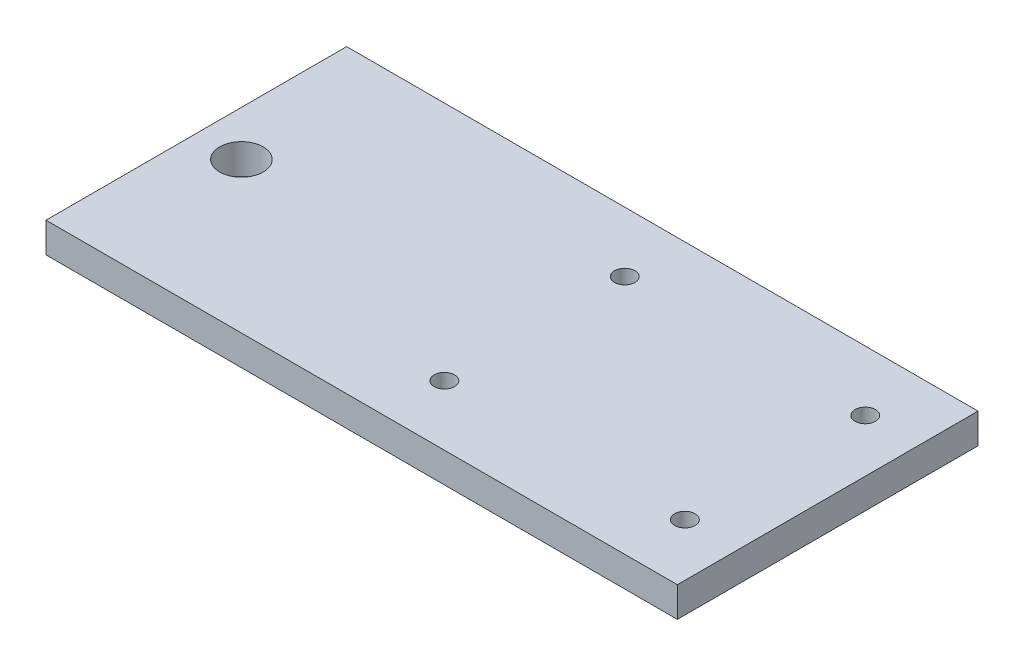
ISO-10303-21;
HEADER;
FILE_DESCRIPTION(('STEP AP214'),'2;1');
FILE_NAME('part.step','',(''),(''),'','','');
FILE_SCHEMA(('AUTOMOTIVE_DESIGN { 1 0 10303 214 1 1 1 1 }'));
ENDSEC;
DATA;
#1=APPLICATION_CONTEXT('core data for automotive mechanical design processes');
#2=APPLICATION_PROTOCOL_DEFINITION('international standard','automotive_design',2000,#1);
#3=PRODUCT_CONTEXT('',#1,'mechanical');
#4=PRODUCT('Part','Part','',(#3));
#5=PRODUCT_RELATED_PRODUCT_CATEGORY('part','',(#4));
#6=PRODUCT_DEFINITION_FORMATION('','',#4);
#7=PRODUCT_DEFINITION_CONTEXT('part definition',#1,'design');
#8=PRODUCT_DEFINITION('design','',#6,#7);
#9=PRODUCT_DEFINITION_SHAPE('','',#8);
#10=(LENGTH_UNIT() NAMED_UNIT(*) SI_UNIT(.MILLI.,.METRE.));
#11=(NAMED_UNIT(*) PLANE_ANGLE_UNIT() SI_UNIT($,.RADIAN.));
#12=(NAMED_UNIT(*) SI_UNIT($,.STERADIAN.) SOLID_ANGLE_UNIT());
#13=UNCERTAINTY_MEASURE_WITH_UNIT(LENGTH_MEASURE(1.E-05),#10,'distance_accuracy_value','');
#14=(GEOMETRIC_REPRESENTATION_CONTEXT(3) GLOBAL_UNCERTAINTY_ASSIGNED_CONTEXT((#13)) GLOBAL_UNIT_ASSIGNED_CONTEXT((#10,
#11,#12)) REPRESENTATION_CONTEXT('',''));
#15=CARTESIAN_POINT('',(0.,0.,0.));
#16=DIRECTION('',(0.,0.,1.));
#17=DIRECTION('',(1.,0.,0.));
#18=AXIS2_PLACEMENT_3D('',#15,#16,#17);
#19=CARTESIAN_POINT('',(105.,0.,50.));
#20=DIRECTION('',(0.,-1.,0.));
#21=DIRECTION('',(0.,0.,-1.));
#22=AXIS2_PLACEMENT_3D('',#19,#20,#21);
#23=PLANE('',#22);
#24=CARTESIAN_POINT('',(7.50000000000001,0.,-29.9999999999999));
#25=DIRECTION('',(0.,1.,0.));
#26=DIRECTION('',(0.,0.,1.));
#27=AXIS2_PLACEMENT_3D('',#24,#25,#26);
#28=CIRCLE('',#27,3.39999999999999);
#29=CARTESIAN_POINT('',(7.50000000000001,0.,-26.5999999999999));
#30=VERTEX_POINT('',#29);
#31=EDGE_CURVE('E208',#30,#30,#28,.T.);
#32=ORIENTED_EDGE('',*,*,#31,.F.);
#33=EDGE_LOOP('',(#32));
#34=FACE_BOUND('',#33,.T.);
#35=CARTESIAN_POINT('',(87.5000000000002,0.,30.));
#36=DIRECTION('',(0.,1.,0.));
#37=DIRECTION('',(0.,0.,1.));
#38=AXIS2_PLACEMENT_3D('',#35,#36,#37);
#39=CIRCLE('',#38,3.39999999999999);
#40=CARTESIAN_POINT('',(87.5000000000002,0.,33.4));
#41=VERTEX_POINT('',#40);
#42=EDGE_CURVE('E221',#41,#41,#39,.T.);
#43=ORIENTED_EDGE('',*,*,#42,.F.);
#44=EDGE_LOOP('',(#43));
#45=FACE_BOUND('',#44,.T.);
#46=CARTESIAN_POINT('',(-90.,0.,0.));
#47=DIRECTION('',(0.,1.,0.));
#48=DIRECTION('',(0.,0.,1.));
#49=AXIS2_PLACEMENT_3D('',#46,#47,#48);
#50=CIRCLE('',#49,7.25000000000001);
#51=CARTESIAN_POINT('',(-90.,0.,7.25000000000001));
#52=VERTEX_POINT('',#51);
#53=EDGE_CURVE('E107',#52,#52,#50,.T.);
#54=ORIENTED_EDGE('',*,*,#53,.F.);
#55=EDGE_LOOP('',(#54));
#56=FACE_BOUND('',#55,.T.);
#57=DIRECTION('',(0.,0.,1.));
#58=VECTOR('',#57,1.);
#59=CARTESIAN_POINT('',(-105.,0.,50.));
#60=LINE('',#59,#58);
#61=CARTESIAN_POINT('',(-105.,0.,-50.));
#62=VERTEX_POINT('',#61);
#63=CARTESIAN_POINT('',(-105.,0.,50.));
#64=VERTEX_POINT('',#63);
#65=EDGE_CURVE('E113',#62,#64,#60,.T.);
#66=ORIENTED_EDGE('',*,*,#65,.T.);
#67=DIRECTION('',(-1.,0.,0.));
#68=VECTOR('',#67,1.);
#69=CARTESIAN_POINT('',(105.,0.,50.));
#70=LINE('',#69,#68);
#71=CARTESIAN_POINT('',(105.,0.,50.));
#72=VERTEX_POINT('',#71);
#73=EDGE_CURVE('E99',#72,#64,#70,.T.);
#74=ORIENTED_EDGE('',*,*,#73,.F.);
#75=DIRECTION('',(0.,0.,1.));
#76=VECTOR('',#75,1.);
#77=CARTESIAN_POINT('',(105.,0.,50.));
#78=LINE('',#77,#76);
#79=CARTESIAN_POINT('',(105.,0.,-50.));
#80=VERTEX_POINT('',#79);
#81=EDGE_CURVE('E56',#80,#72,#78,.T.);
#82=ORIENTED_EDGE('',*,*,#81,.F.);
#83=DIRECTION('',(-1.,0.,0.));
#84=VECTOR('',#83,1.);
#85=CARTESIAN_POINT('',(105.,0.,-50.));
#86=LINE('',#85,#84);
#87=EDGE_CURVE('E126',#80,#62,#86,.T.);
#88=ORIENTED_EDGE('',*,*,#87,.T.);
#89=EDGE_LOOP('',(#66,#74,#82,#88));
#90=FACE_BOUND('',#89,.T.);
#91=CARTESIAN_POINT('',(87.5,0.,-30.));
#92=DIRECTION('',(0.,1.,0.));
#93=DIRECTION('',(0.,0.,1.));
#94=AXIS2_PLACEMENT_3D('',#91,#92,#93);
#95=CIRCLE('',#94,3.39999999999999);
#96=CARTESIAN_POINT('',(87.5,0.,-26.6));
#97=VERTEX_POINT('',#96);
#98=EDGE_CURVE('E215',#97,#97,#95,.T.);
#99=ORIENTED_EDGE('',*,*,#98,.F.);
#100=EDGE_LOOP('',(#99));
#101=FACE_BOUND('',#100,.T.);
#102=CARTESIAN_POINT('',(7.49999999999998,0.,30.));
#103=DIRECTION('',(0.,1.,0.));
#104=DIRECTION('',(0.,0.,1.));
#105=AXIS2_PLACEMENT_3D('',#102,#103,#104);
#106=CIRCLE('',#105,3.39999999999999);
#107=CARTESIAN_POINT('',(7.49999999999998,0.,33.4));
#108=VERTEX_POINT('',#107);
#109=EDGE_CURVE('E202',#108,#108,#106,.T.);
#110=ORIENTED_EDGE('',*,*,#109,.F.);
#111=EDGE_LOOP('',(#110));
#112=FACE_BOUND('',#111,.T.);
#113=ADVANCED_FACE('F40',(#34,#45,#56,#90,#101,#112),#23,.F.);
#114=CARTESIAN_POINT('',(105.,0.,50.));
#115=DIRECTION('',(0.,0.,-1.));
#116=DIRECTION('',(-1.,0.,0.));
#117=AXIS2_PLACEMENT_3D('',#114,#115,#116);
#118=PLANE('',#117);
#119=DIRECTION('',(0.,-1.,0.));
#120=VECTOR('',#119,1.);
#121=CARTESIAN_POINT('',(-105.,0.,50.));
#122=LINE('',#121,#120);
#123=CARTESIAN_POINT('',(-105.,-10.,50.));
#124=VERTEX_POINT('',#123);
#125=EDGE_CURVE('E86',#64,#124,#122,.T.);
#126=ORIENTED_EDGE('',*,*,#125,.T.);
#127=DIRECTION('',(-1.,0.,0.));
#128=VECTOR('',#127,1.);
#129=CARTESIAN_POINT('',(105.,-10.,50.));
#130=LINE('',#129,#128);
#131=CARTESIAN_POINT('',(105.,-10.,50.));
#132=VERTEX_POINT('',#131);
#133=EDGE_CURVE('E11',#132,#124,#130,.T.);
#134=ORIENTED_EDGE('',*,*,#133,.F.);
#135=DIRECTION('',(0.,-1.,0.));
#136=VECTOR('',#135,1.);
#137=CARTESIAN_POINT('',(105.,0.,50.));
#138=LINE('',#137,#136);
#139=EDGE_CURVE('E116',#72,#132,#138,.T.);
#140=ORIENTED_EDGE('',*,*,#139,.F.);
#141=ORIENTED_EDGE('',*,*,#73,.T.);
#142=EDGE_LOOP('',(#126,#134,#140,#141));
#143=FACE_BOUND('',#142,.T.);
#144=ADVANCED_FACE('F42',(#143),#118,.F.);
#145=CARTESIAN_POINT('',(105.,-10.,50.));
#146=DIRECTION('',(0.,1.,0.));
#147=DIRECTION('',(0.,0.,1.));
#148=AXIS2_PLACEMENT_3D('',#145,#146,#147);
#149=PLANE('',#148);
#150=CARTESIAN_POINT('',(7.49999999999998,-10.,30.));
#151=DIRECTION('',(0.,1.,0.));
#152=DIRECTION('',(0.,0.,1.));
#153=AXIS2_PLACEMENT_3D('',#150,#151,#152);
#154=CIRCLE('',#153,3.39999999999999);
#155=CARTESIAN_POINT('',(7.49999999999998,-10.,33.4));
#156=VERTEX_POINT('',#155);
#157=EDGE_CURVE('E160',#156,#156,#154,.T.);
#158=ORIENTED_EDGE('',*,*,#157,.T.);
#159=EDGE_LOOP('',(#158));
#160=FACE_BOUND('',#159,.T.);
#161=CARTESIAN_POINT('',(7.50000000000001,-10.,-29.9999999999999));
#162=DIRECTION('',(0.,1.,0.));
#163=DIRECTION('',(0.,0.,1.));
#164=AXIS2_PLACEMENT_3D('',#161,#162,#163);
#165=CIRCLE('',#164,3.39999999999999);
#166=CARTESIAN_POINT('',(7.50000000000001,-10.,-26.5999999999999));
#167=VERTEX_POINT('',#166);
#168=EDGE_CURVE('E164',#167,#167,#165,.T.);
#169=ORIENTED_EDGE('',*,*,#168,.T.);
#170=EDGE_LOOP('',(#169));
#171=FACE_BOUND('',#170,.T.);
#172=CARTESIAN_POINT('',(87.5000000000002,-10.,-30.));
#173=DIRECTION('',(0.,1.,0.));
#174=DIRECTION('',(0.,0.,1.));
#175=AXIS2_PLACEMENT_3D('',#172,#173,#174);
#176=CIRCLE('',#175,3.39999999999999);
#177=CARTESIAN_POINT('',(87.5000000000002,-10.,-26.6));
#178=VERTEX_POINT('',#177);
#179=EDGE_CURVE('E168',#178,#178,#176,.T.);
#180=ORIENTED_EDGE('',*,*,#179,.T.);
#181=EDGE_LOOP('',(#180));
#182=FACE_BOUND('',#181,.T.);
#183=CARTESIAN_POINT('',(87.5,-10.,30.));
#184=DIRECTION('',(0.,1.,0.));
#185=DIRECTION('',(0.,0.,1.));
#186=AXIS2_PLACEMENT_3D('',#183,#184,#185);
#187=CIRCLE('',#186,3.39999999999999);
#188=CARTESIAN_POINT('',(87.5,-10.,33.4));
#189=VERTEX_POINT('',#188);
#190=EDGE_CURVE('E172',#189,#189,#187,.T.);
#191=ORIENTED_EDGE('',*,*,#190,.T.);
#192=EDGE_LOOP('',(#191));
#193=FACE_BOUND('',#192,.T.);
#194=CARTESIAN_POINT('',(-90.,-10.,0.));
#195=DIRECTION('',(0.,1.,0.));
#196=DIRECTION('',(0.,0.,1.));
#197=AXIS2_PLACEMENT_3D('',#194,#195,#196);
#198=CIRCLE('',#197,7.25000000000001);
#199=CARTESIAN_POINT('',(-90.,-10.,7.25000000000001));
#200=VERTEX_POINT('',#199);
#201=EDGE_CURVE('E101',#200,#200,#198,.T.);
#202=ORIENTED_EDGE('',*,*,#201,.T.);
#203=EDGE_LOOP('',(#202));
#204=FACE_BOUND('',#203,.T.);
#205=DIRECTION('',(0.,0.,-1.));
#206=VECTOR('',#205,1.);
#207=CARTESIAN_POINT('',(-105.,-10.,50.));
#208=LINE('',#207,#206);
#209=CARTESIAN_POINT('',(-105.,-10.,-50.));
#210=VERTEX_POINT('',#209);
#211=EDGE_CURVE('E82',#124,#210,#208,.T.);
#212=ORIENTED_EDGE('',*,*,#211,.T.);
#213=DIRECTION('',(-1.,0.,0.));
#214=VECTOR('',#213,1.);
#215=CARTESIAN_POINT('',(105.,-10.,-50.));
#216=LINE('',#215,#214);
#217=CARTESIAN_POINT('',(105.,-10.,-50.));
#218=VERTEX_POINT('',#217);
#219=EDGE_CURVE('E49',#218,#210,#216,.T.);
#220=ORIENTED_EDGE('',*,*,#219,.F.);
#221=DIRECTION('',(0.,0.,-1.));
#222=VECTOR('',#221,1.);
#223=CARTESIAN_POINT('',(105.,-10.,50.));
#224=LINE('',#223,#222);
#225=EDGE_CURVE('E95',#132,#218,#224,.T.);
#226=ORIENTED_EDGE('',*,*,#225,.F.);
#227=ORIENTED_EDGE('',*,*,#133,.T.);
#228=EDGE_LOOP('',(#212,#220,#226,#227));
#229=FACE_BOUND('',#228,.T.);
#230=ADVANCED_FACE('F94',(#160,#171,#182,#193,#204,#229),#149,.F.);
#231=CARTESIAN_POINT('',(105.,0.,-50.));
#232=DIRECTION('',(0.,0.,1.));
#233=DIRECTION('',(1.,0.,0.));
#234=AXIS2_PLACEMENT_3D('',#231,#232,#233);
#235=PLANE('',#234);
#236=DIRECTION('',(0.,1.,0.));
#237=VECTOR('',#236,1.);
#238=CARTESIAN_POINT('',(-105.,0.,-50.));
#239=LINE('',#238,#237);
#240=EDGE_CURVE('E87',#210,#62,#239,.T.);
#241=ORIENTED_EDGE('',*,*,#240,.T.);
#242=ORIENTED_EDGE('',*,*,#87,.F.);
#243=DIRECTION('',(0.,1.,0.));
#244=VECTOR('',#243,1.);
#245=CARTESIAN_POINT('',(105.,0.,-50.));
#246=LINE('',#245,#244);
#247=EDGE_CURVE('E61',#218,#80,#246,.T.);
#248=ORIENTED_EDGE('',*,*,#247,.F.);
#249=ORIENTED_EDGE('',*,*,#219,.T.);
#250=EDGE_LOOP('',(#241,#242,#248,#249));
#251=FACE_BOUND('',#250,.T.);
#252=ADVANCED_FACE('F132',(#251),#235,.F.);
#253=CARTESIAN_POINT('',(105.,0.,50.));
#254=DIRECTION('',(1.,0.,0.));
#255=DIRECTION('',(0.,0.,-1.));
#256=AXIS2_PLACEMENT_3D('',#253,#254,#255);
#257=PLANE('',#256);
#258=ORIENTED_EDGE('',*,*,#139,.T.);
#259=ORIENTED_EDGE('',*,*,#225,.T.);
#260=ORIENTED_EDGE('',*,*,#247,.T.);
#261=ORIENTED_EDGE('',*,*,#81,.T.);
#262=EDGE_LOOP('',(#258,#259,#260,#261));
#263=FACE_BOUND('',#262,.T.);
#264=ADVANCED_FACE('F135',(#263),#257,.T.);
#265=CARTESIAN_POINT('',(-105.,0.,50.));
#266=DIRECTION('',(1.,0.,0.));
#267=DIRECTION('',(0.,0.,-1.));
#268=AXIS2_PLACEMENT_3D('',#265,#266,#267);
#269=PLANE('',#268);
#270=ORIENTED_EDGE('',*,*,#125,.F.);
#271=ORIENTED_EDGE('',*,*,#65,.F.);
#272=ORIENTED_EDGE('',*,*,#240,.F.);
#273=ORIENTED_EDGE('',*,*,#211,.F.);
#274=EDGE_LOOP('',(#270,#271,#272,#273));
#275=FACE_BOUND('',#274,.T.);
#276=ADVANCED_FACE('F83',(#275),#269,.F.);
#277=CARTESIAN_POINT('',(-90.,-210.,0.));
#278=DIRECTION('',(0.,1.,0.));
#279=DIRECTION('',(0.,0.,1.));
#280=AXIS2_PLACEMENT_3D('',#277,#278,#279);
#281=CYLINDRICAL_SURFACE('',#280,7.25000000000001);
#282=ORIENTED_EDGE('',*,*,#53,.T.);
#283=EDGE_LOOP('',(#282));
#284=FACE_BOUND('',#283,.T.);
#285=ORIENTED_EDGE('',*,*,#201,.F.);
#286=EDGE_LOOP('',(#285));
#287=FACE_BOUND('',#286,.T.);
#288=ADVANCED_FACE('F142',(#284,#287),#281,.F.);
#289=CARTESIAN_POINT('',(87.5000000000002,0.,30.));
#290=DIRECTION('',(0.,1.,0.));
#291=DIRECTION('',(0.,0.,1.));
#292=AXIS2_PLACEMENT_3D('',#289,#290,#291);
#293=CYLINDRICAL_SURFACE('',#292,3.39999999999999);
#294=ORIENTED_EDGE('',*,*,#190,.F.);
#295=EDGE_LOOP('',(#294));
#296=FACE_BOUND('',#295,.T.);
#297=ORIENTED_EDGE('',*,*,#42,.T.);
#298=EDGE_LOOP('',(#297));
#299=FACE_BOUND('',#298,.T.);
#300=ADVANCED_FACE('F176',(#296,#299),#293,.F.);
#301=CARTESIAN_POINT('',(87.5,0.,-30.));
#302=DIRECTION('',(0.,1.,0.));
#303=DIRECTION('',(0.,0.,1.));
#304=AXIS2_PLACEMENT_3D('',#301,#302,#303);
#305=CYLINDRICAL_SURFACE('',#304,3.39999999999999);
#306=ORIENTED_EDGE('',*,*,#179,.F.);
#307=EDGE_LOOP('',(#306));
#308=FACE_BOUND('',#307,.T.);
#309=ORIENTED_EDGE('',*,*,#98,.T.);
#310=EDGE_LOOP('',(#309));
#311=FACE_BOUND('',#310,.T.);
#312=ADVANCED_FACE('F182',(#308,#311),#305,.F.);
#313=CARTESIAN_POINT('',(7.50000000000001,0.,-29.9999999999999));
#314=DIRECTION('',(0.,1.,0.));
#315=DIRECTION('',(0.,0.,1.));
#316=AXIS2_PLACEMENT_3D('',#313,#314,#315);
#317=CYLINDRICAL_SURFACE('',#316,3.39999999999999);
#318=ORIENTED_EDGE('',*,*,#168,.F.);
#319=EDGE_LOOP('',(#318));
#320=FACE_BOUND('',#319,.T.);
#321=ORIENTED_EDGE('',*,*,#31,.T.);
#322=EDGE_LOOP('',(#321));
#323=FACE_BOUND('',#322,.T.);
#324=ADVANCED_FACE('F189',(#320,#323),#317,.F.);
#325=CARTESIAN_POINT('',(7.49999999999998,0.,30.));
#326=DIRECTION('',(0.,1.,0.));
#327=DIRECTION('',(0.,0.,1.));
#328=AXIS2_PLACEMENT_3D('',#325,#326,#327);
#329=CYLINDRICAL_SURFACE('',#328,3.39999999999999);
#330=ORIENTED_EDGE('',*,*,#157,.F.);
#331=EDGE_LOOP('',(#330));
#332=FACE_BOUND('',#331,.T.);
#333=ORIENTED_EDGE('',*,*,#109,.T.);
#334=EDGE_LOOP('',(#333));
#335=FACE_BOUND('',#334,.T.);
#336=ADVANCED_FACE('F193',(#332,#335),#329,.F.);
#337=CLOSED_SHELL('',(#113,#144,#230,#252,#264,#276,#288,#300,#312,#324,#336));
#338=MANIFOLD_SOLID_BREP('B2',#337);
#339=ADVANCED_BREP_SHAPE_REPRESENTATION('',(#18,#338),#14);
#340=SHAPE_DEFINITION_REPRESENTATION(#9,#339);
ENDSEC;
END-ISO-10303-21;
